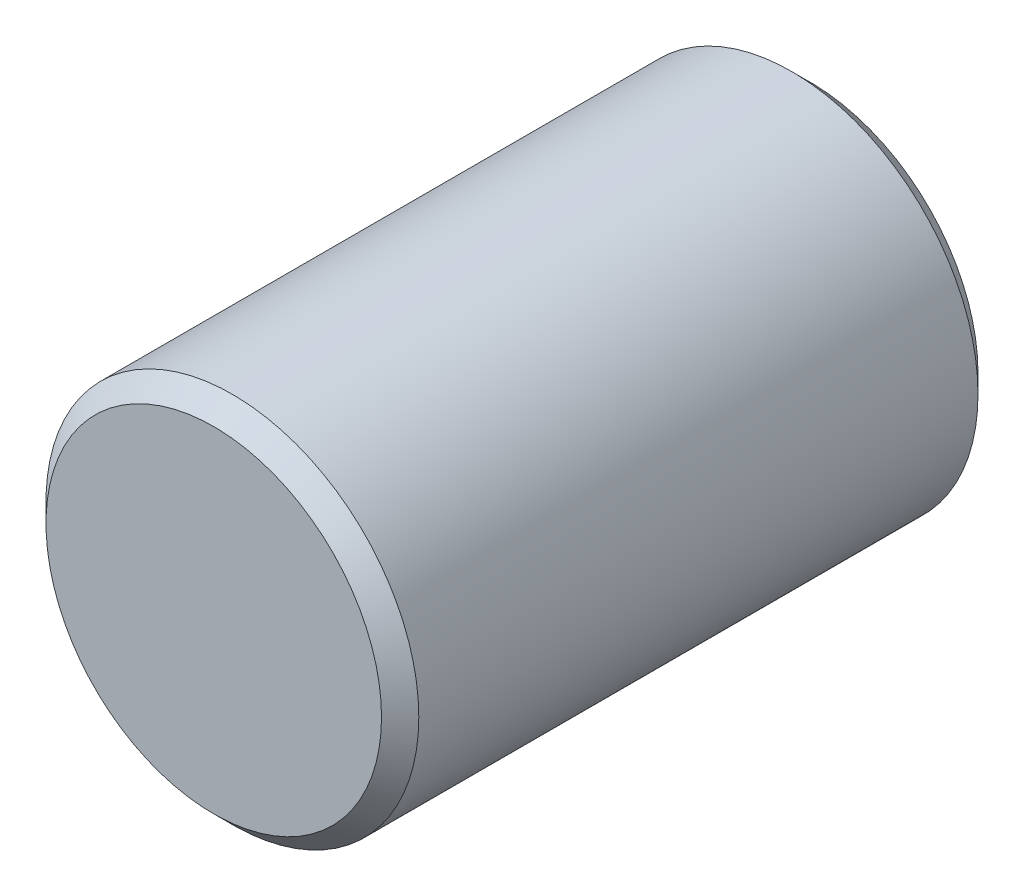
ISO-10303-21;
HEADER;
FILE_DESCRIPTION(('STEP AP214'),'2;1');
FILE_NAME('part.step','',(''),(''),'','','');
FILE_SCHEMA(('AUTOMOTIVE_DESIGN { 1 0 10303 214 1 1 1 1 }'));
ENDSEC;
DATA;
#1=APPLICATION_CONTEXT('core data for automotive mechanical design processes');
#2=APPLICATION_PROTOCOL_DEFINITION('international standard','automotive_design',2000,#1);
#3=PRODUCT_CONTEXT('',#1,'mechanical');
#4=PRODUCT('Part','Part','',(#3));
#5=PRODUCT_RELATED_PRODUCT_CATEGORY('part','',(#4));
#6=PRODUCT_DEFINITION_FORMATION('','',#4);
#7=PRODUCT_DEFINITION_CONTEXT('part definition',#1,'design');
#8=PRODUCT_DEFINITION('design','',#6,#7);
#9=PRODUCT_DEFINITION_SHAPE('','',#8);
#10=(LENGTH_UNIT() NAMED_UNIT(*) SI_UNIT(.MILLI.,.METRE.));
#11=(NAMED_UNIT(*) PLANE_ANGLE_UNIT() SI_UNIT($,.RADIAN.));
#12=(NAMED_UNIT(*) SI_UNIT($,.STERADIAN.) SOLID_ANGLE_UNIT());
#13=UNCERTAINTY_MEASURE_WITH_UNIT(LENGTH_MEASURE(1.E-05),#10,'distance_accuracy_value','');
#14=(GEOMETRIC_REPRESENTATION_CONTEXT(3) GLOBAL_UNCERTAINTY_ASSIGNED_CONTEXT((#13)) GLOBAL_UNIT_ASSIGNED_CONTEXT((#10,
#11,#12)) REPRESENTATION_CONTEXT('',''));
#15=CARTESIAN_POINT('',(0.,0.,0.));
#16=DIRECTION('',(0.,0.,1.));
#17=DIRECTION('',(1.,0.,0.));
#18=AXIS2_PLACEMENT_3D('',#15,#16,#17);
#19=CARTESIAN_POINT('',(0.,0.,-10.6746912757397));
#20=DIRECTION('',(0.,0.,1.));
#21=DIRECTION('',(1.,0.,0.));
#22=AXIS2_PLACEMENT_3D('',#19,#20,#21);
#23=CYLINDRICAL_SURFACE('',#22,2.5);
#24=CARTESIAN_POINT('',(0.,0.,-0.250013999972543));
#25=DIRECTION('',(0.,0.,1.));
#26=DIRECTION('',(1.,0.,0.));
#27=AXIS2_PLACEMENT_3D('',#24,#25,#26);
#28=CIRCLE('',#27,2.5);
#29=CARTESIAN_POINT('',(2.5,0.,-0.250013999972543));
#30=VERTEX_POINT('',#29);
#31=EDGE_CURVE('E10',#30,#30,#28,.T.);
#32=ORIENTED_EDGE('',*,*,#31,.F.);
#33=EDGE_LOOP('',(#32));
#34=FACE_BOUND('',#33,.T.);
#35=CARTESIAN_POINT('',(0.,0.,-7.74998600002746));
#36=DIRECTION('',(0.,0.,1.));
#37=DIRECTION('',(1.,0.,0.));
#38=AXIS2_PLACEMENT_3D('',#35,#36,#37);
#39=CIRCLE('',#38,2.5);
#40=CARTESIAN_POINT('',(2.5,0.,-7.74998600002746));
#41=VERTEX_POINT('',#40);
#42=EDGE_CURVE('E44',#41,#41,#39,.T.);
#43=ORIENTED_EDGE('',*,*,#42,.T.);
#44=EDGE_LOOP('',(#43));
#45=FACE_BOUND('',#44,.T.);
#46=ADVANCED_FACE('F30',(#34,#45),#23,.T.);
#47=CARTESIAN_POINT('',(0.,0.,-0.250013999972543));
#48=DIRECTION('',(0.,0.,-1.));
#49=DIRECTION('',(-1.,0.,0.));
#50=AXIS2_PLACEMENT_3D('',#47,#48,#49);
#51=CONICAL_SURFACE('',#50,2.5,0.785398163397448);
#52=CARTESIAN_POINT('',(0.,0.,0.));
#53=DIRECTION('',(0.,0.,1.));
#54=DIRECTION('',(1.,0.,0.));
#55=AXIS2_PLACEMENT_3D('',#52,#53,#54);
#56=CIRCLE('',#55,2.24998600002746);
#57=CARTESIAN_POINT('',(2.24998600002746,0.,0.));
#58=VERTEX_POINT('',#57);
#59=EDGE_CURVE('E36',#58,#58,#56,.T.);
#60=ORIENTED_EDGE('',*,*,#59,.F.);
#61=EDGE_LOOP('',(#60));
#62=FACE_BOUND('',#61,.T.);
#63=ORIENTED_EDGE('',*,*,#31,.T.);
#64=EDGE_LOOP('',(#63));
#65=FACE_BOUND('',#64,.T.);
#66=ADVANCED_FACE('F64',(#62,#65),#51,.T.);
#67=CARTESIAN_POINT('',(0.,2.24998600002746,0.));
#68=DIRECTION('',(0.,0.,-1.));
#69=DIRECTION('',(-1.,0.,0.));
#70=AXIS2_PLACEMENT_3D('',#67,#68,#69);
#71=PLANE('',#70);
#72=ORIENTED_EDGE('',*,*,#59,.T.);
#73=EDGE_LOOP('',(#72));
#74=FACE_BOUND('',#73,.T.);
#75=ADVANCED_FACE('F59',(#74),#71,.F.);
#76=CARTESIAN_POINT('',(0.,0.,-8.));
#77=DIRECTION('',(0.,0.,1.));
#78=DIRECTION('',(1.,0.,0.));
#79=AXIS2_PLACEMENT_3D('',#76,#77,#78);
#80=PLANE('',#79);
#81=CARTESIAN_POINT('',(0.,0.,-8.));
#82=DIRECTION('',(0.,0.,1.));
#83=DIRECTION('',(1.,0.,0.));
#84=AXIS2_PLACEMENT_3D('',#81,#82,#83);
#85=CIRCLE('',#84,2.24998600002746);
#86=CARTESIAN_POINT('',(2.24998600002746,0.,-8.));
#87=VERTEX_POINT('',#86);
#88=EDGE_CURVE('E40',#87,#87,#85,.T.);
#89=ORIENTED_EDGE('',*,*,#88,.F.);
#90=EDGE_LOOP('',(#89));
#91=FACE_BOUND('',#90,.T.);
#92=ADVANCED_FACE('F54',(#91),#80,.F.);
#93=CARTESIAN_POINT('',(0.,0.,-8.));
#94=DIRECTION('',(0.,0.,1.));
#95=DIRECTION('',(1.,0.,0.));
#96=AXIS2_PLACEMENT_3D('',#93,#94,#95);
#97=CONICAL_SURFACE('',#96,2.24998600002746,0.785398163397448);
#98=ORIENTED_EDGE('',*,*,#42,.F.);
#99=EDGE_LOOP('',(#98));
#100=FACE_BOUND('',#99,.T.);
#101=ORIENTED_EDGE('',*,*,#88,.T.);
#102=EDGE_LOOP('',(#101));
#103=FACE_BOUND('',#102,.T.);
#104=ADVANCED_FACE('F51',(#100,#103),#97,.T.);
#105=CLOSED_SHELL('',(#46,#66,#75,#92,#104));
#106=MANIFOLD_SOLID_BREP('B2',#105);
#107=ADVANCED_BREP_SHAPE_REPRESENTATION('',(#18,#106),#14);
#108=SHAPE_DEFINITION_REPRESENTATION(#9,#107);
ENDSEC;
END-ISO-10303-21;
